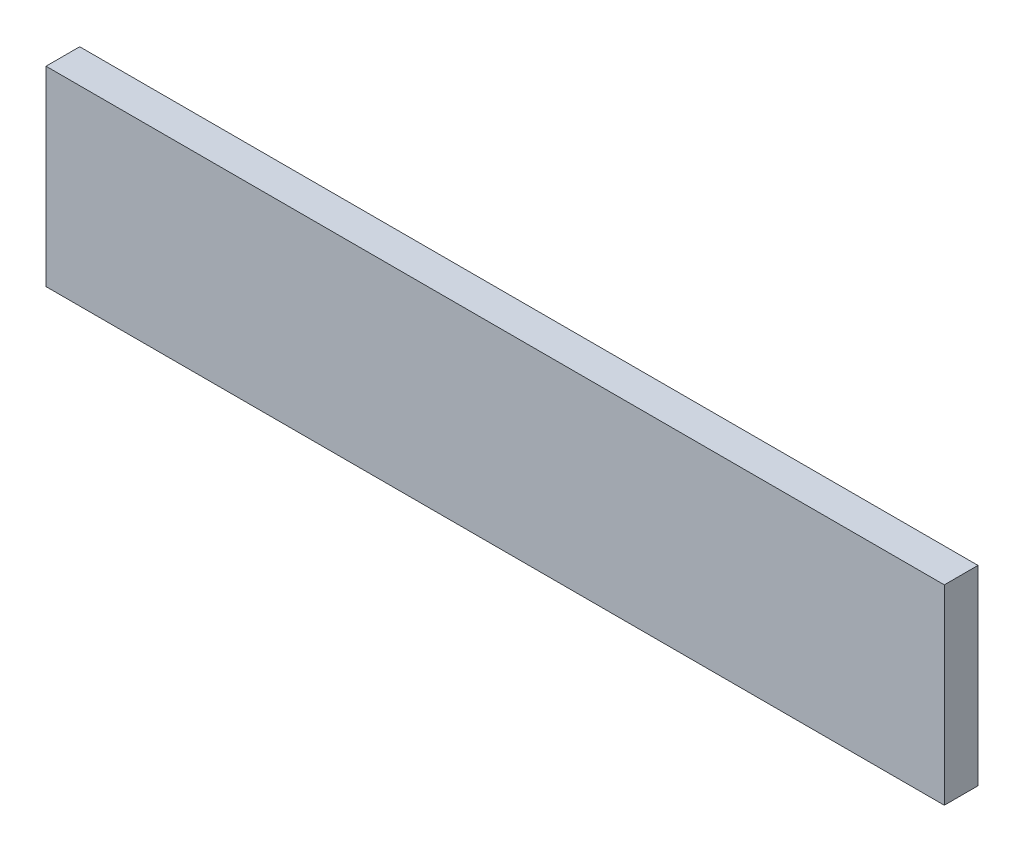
from build123d import *

# Parameters (mm, degrees)
CROQUIS1_W              = 400
CROQUIS1_H              = 85
SALIENTE_EXTRUIR1_DEPTH = 15


with BuildPart() as part:
    # Croquis1 → Saliente-Extruir1 (new body)
    with BuildSketch(Plane.XY):
        Rectangle(CROQUIS1_W, CROQUIS1_H)
    extrude(amount=SALIENTE_EXTRUIR1_DEPTH)


solid = part.part
